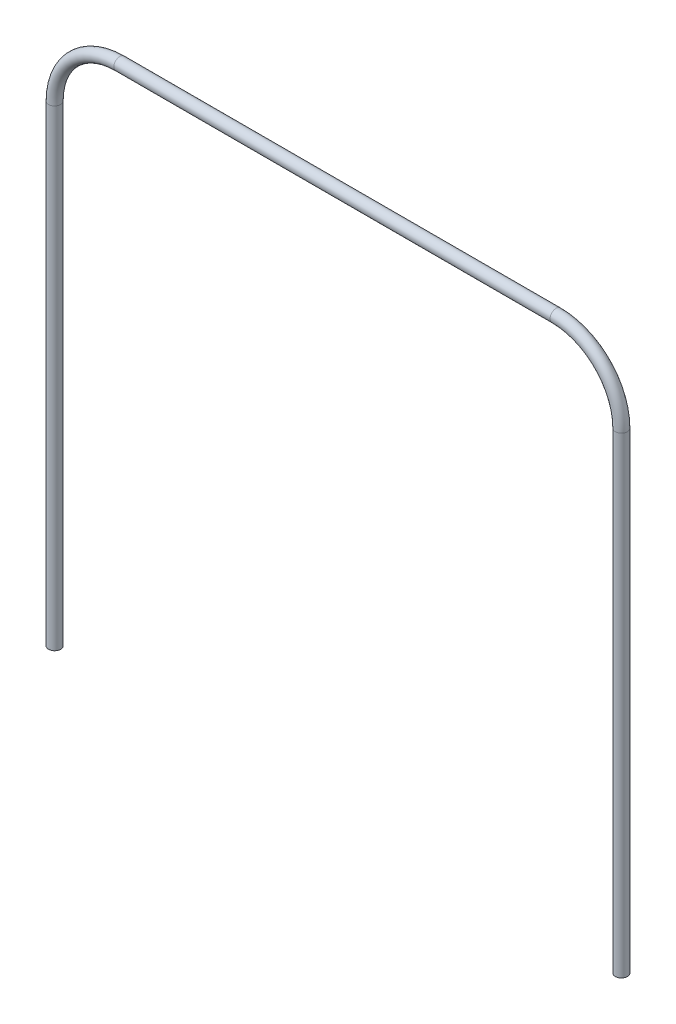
from build123d import *

# Parameters (mm, degrees)
ESQUISSE2_R = 6


with BuildPart() as part:
    # Base-Balayage: sweep along a path in Esquisse1
    with BuildLine(Plane.XY) as base_balayage_path:
        Line((0, 0), (0, 470))
        ThreePointArc((0, 470), (19.038059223, 515.961940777), (65, 535))
        Line((65, 535), (499.55, 535))
        ThreePointArc((499.55, 535), (545.511940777, 515.961940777), (564.55, 470))
        Line((564.55, 470), (564.55, 0))
    # Esquisse2 → Base-Balayage (sweep)
    with BuildSketch(Plane(origin=(0, 0, 0), x_dir=(1, 0, 0), z_dir=(0, 1, 0))):
        Circle(ESQUISSE2_R)
    sweep(path=base_balayage_path.line)


solid = part.part
